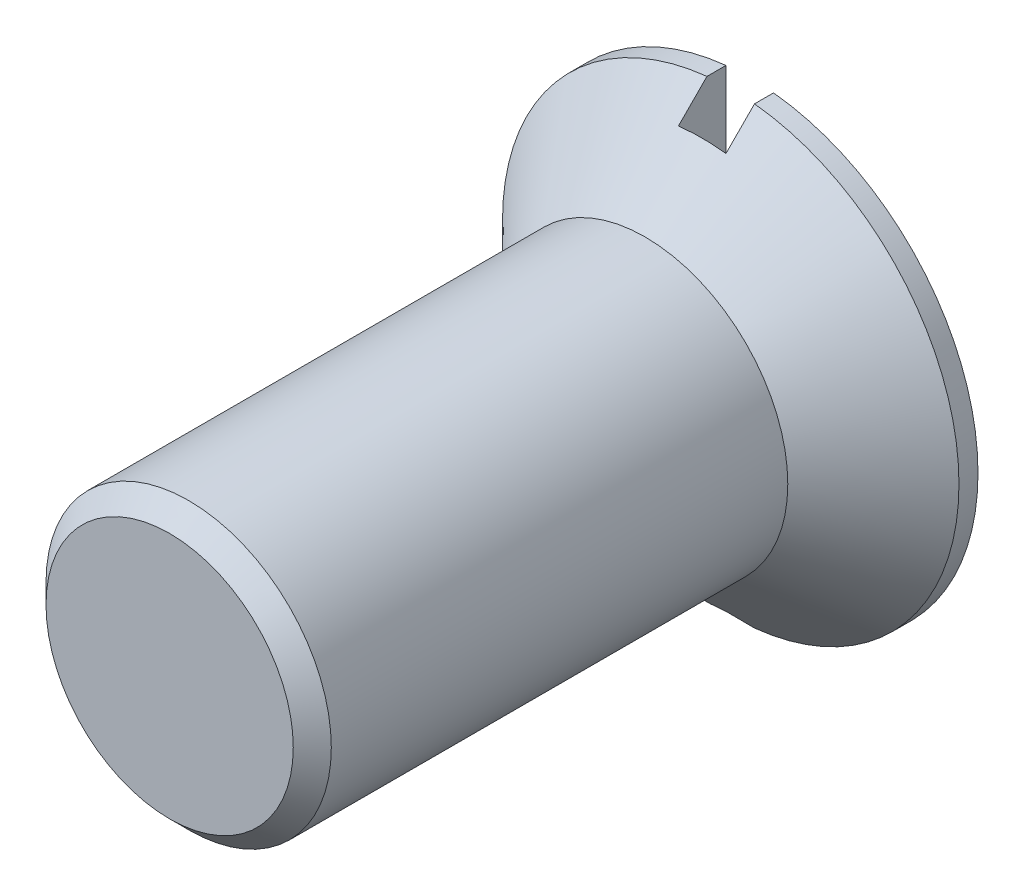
ISO-10303-21;
HEADER;
FILE_DESCRIPTION(('STEP AP214'),'2;1');
FILE_NAME('part.step','',(''),(''),'','','');
FILE_SCHEMA(('AUTOMOTIVE_DESIGN { 1 0 10303 214 1 1 1 1 }'));
ENDSEC;
DATA;
#1=APPLICATION_CONTEXT('core data for automotive mechanical design processes');
#2=APPLICATION_PROTOCOL_DEFINITION('international standard','automotive_design',2000,#1);
#3=PRODUCT_CONTEXT('',#1,'mechanical');
#4=PRODUCT('Part','Part','',(#3));
#5=PRODUCT_RELATED_PRODUCT_CATEGORY('part','',(#4));
#6=PRODUCT_DEFINITION_FORMATION('','',#4);
#7=PRODUCT_DEFINITION_CONTEXT('part definition',#1,'design');
#8=PRODUCT_DEFINITION('design','',#6,#7);
#9=PRODUCT_DEFINITION_SHAPE('','',#8);
#10=(LENGTH_UNIT() NAMED_UNIT(*) SI_UNIT(.MILLI.,.METRE.));
#11=(NAMED_UNIT(*) PLANE_ANGLE_UNIT() SI_UNIT($,.RADIAN.));
#12=(NAMED_UNIT(*) SI_UNIT($,.STERADIAN.) SOLID_ANGLE_UNIT());
#13=UNCERTAINTY_MEASURE_WITH_UNIT(LENGTH_MEASURE(1.E-05),#10,'distance_accuracy_value','');
#14=(GEOMETRIC_REPRESENTATION_CONTEXT(3) GLOBAL_UNCERTAINTY_ASSIGNED_CONTEXT((#13)) GLOBAL_UNIT_ASSIGNED_CONTEXT((#10,
#11,#12)) REPRESENTATION_CONTEXT('',''));
#15=CARTESIAN_POINT('',(0.,0.,0.));
#16=DIRECTION('',(0.,0.,1.));
#17=DIRECTION('',(1.,0.,0.));
#18=AXIS2_PLACEMENT_3D('',#15,#16,#17);
#19=CARTESIAN_POINT('',(0.,0.,0.));
#20=DIRECTION('',(0.,0.,1.));
#21=DIRECTION('',(1.,0.,0.));
#22=AXIS2_PLACEMENT_3D('',#19,#20,#21);
#23=CYLINDRICAL_SURFACE('',#22,2.4);
#24=CARTESIAN_POINT('',(0.,0.,-1.1));
#25=DIRECTION('',(0.,0.,1.));
#26=DIRECTION('',(1.,0.,0.));
#27=AXIS2_PLACEMENT_3D('',#24,#25,#26);
#28=CIRCLE('',#27,2.4);
#29=CARTESIAN_POINT('',(-0.25,2.386943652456,-1.1));
#30=VERTEX_POINT('',#29);
#31=CARTESIAN_POINT('',(-0.25,-2.386943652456,-1.1));
#32=VERTEX_POINT('',#31);
#33=EDGE_CURVE('E117',#30,#32,#28,.T.);
#34=ORIENTED_EDGE('',*,*,#33,.T.);
#35=DIRECTION('',(0.,0.,1.));
#36=VECTOR('',#35,1.);
#37=CARTESIAN_POINT('',(-0.25,-2.386943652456,0.));
#38=LINE('',#37,#36);
#39=CARTESIAN_POINT('',(-0.25,-2.386943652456,-0.899999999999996));
#40=VERTEX_POINT('',#39);
#41=EDGE_CURVE('E120',#32,#40,#38,.T.);
#42=ORIENTED_EDGE('',*,*,#41,.T.);
#43=CARTESIAN_POINT('',(0.,0.,-0.899999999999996));
#44=DIRECTION('',(0.,0.,1.));
#45=DIRECTION('',(1.,0.,0.));
#46=AXIS2_PLACEMENT_3D('',#43,#44,#45);
#47=CIRCLE('',#46,2.4);
#48=CARTESIAN_POINT('',(-0.25,2.386943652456,-0.899999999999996));
#49=VERTEX_POINT('',#48);
#50=EDGE_CURVE('E126',#49,#40,#47,.T.);
#51=ORIENTED_EDGE('',*,*,#50,.F.);
#52=DIRECTION('',(0.,0.,1.));
#53=VECTOR('',#52,1.);
#54=CARTESIAN_POINT('',(-0.25,2.386943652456,0.));
#55=LINE('',#54,#53);
#56=EDGE_CURVE('E155',#49,#30,#55,.F.);
#57=ORIENTED_EDGE('',*,*,#56,.T.);
#58=EDGE_LOOP('',(#34,#42,#51,#57));
#59=FACE_BOUND('',#58,.T.);
#60=ADVANCED_FACE('F46',(#59),#23,.T.);
#61=CARTESIAN_POINT('',(-2.4,0.,-1.1));
#62=DIRECTION('',(0.,0.,1.));
#63=DIRECTION('',(1.,0.,0.));
#64=AXIS2_PLACEMENT_3D('',#61,#62,#63);
#65=PLANE('',#64);
#66=ORIENTED_EDGE('',*,*,#33,.F.);
#67=DIRECTION('',(0.,-1.,0.));
#68=VECTOR('',#67,1.);
#69=CARTESIAN_POINT('',(-0.25,0.,-1.1));
#70=LINE('',#69,#68);
#71=EDGE_CURVE('E104',#30,#32,#70,.T.);
#72=ORIENTED_EDGE('',*,*,#71,.T.);
#73=EDGE_LOOP('',(#66,#72));
#74=FACE_BOUND('',#73,.T.);
#75=ADVANCED_FACE('F174',(#74),#65,.F.);
#76=CARTESIAN_POINT('',(0.,0.,5.));
#77=DIRECTION('',(0.,0.,-1.));
#78=DIRECTION('',(-1.,0.,0.));
#79=AXIS2_PLACEMENT_3D('',#76,#77,#78);
#80=CYLINDRICAL_SURFACE('',#79,1.5);
#81=CARTESIAN_POINT('',(0.,0.,4.8));
#82=DIRECTION('',(0.,0.,1.));
#83=DIRECTION('',(1.,0.,0.));
#84=AXIS2_PLACEMENT_3D('',#81,#82,#83);
#85=CIRCLE('',#84,1.5);
#86=CARTESIAN_POINT('',(-1.5,0.,4.8));
#87=VERTEX_POINT('',#86);
#88=EDGE_CURVE('E105',#87,#87,#85,.F.);
#89=ORIENTED_EDGE('',*,*,#88,.T.);
#90=EDGE_LOOP('',(#89));
#91=FACE_BOUND('',#90,.T.);
#92=CARTESIAN_POINT('',(0.,0.,0.));
#93=DIRECTION('',(0.,0.,1.));
#94=DIRECTION('',(1.,0.,0.));
#95=AXIS2_PLACEMENT_3D('',#92,#93,#94);
#96=CIRCLE('',#95,1.5);
#97=CARTESIAN_POINT('',(1.5,0.,0.));
#98=VERTEX_POINT('',#97);
#99=EDGE_CURVE('E127',#98,#98,#96,.T.);
#100=ORIENTED_EDGE('',*,*,#99,.T.);
#101=EDGE_LOOP('',(#100));
#102=FACE_BOUND('',#101,.T.);
#103=ADVANCED_FACE('F183',(#91,#102),#80,.T.);
#104=CARTESIAN_POINT('',(0.,0.,5.));
#105=DIRECTION('',(0.,0.,1.));
#106=DIRECTION('',(1.,0.,0.));
#107=AXIS2_PLACEMENT_3D('',#104,#105,#106);
#108=PLANE('',#107);
#109=CARTESIAN_POINT('',(0.,0.,5.));
#110=DIRECTION('',(0.,0.,1.));
#111=DIRECTION('',(1.,0.,0.));
#112=AXIS2_PLACEMENT_3D('',#109,#110,#111);
#113=CIRCLE('',#112,1.3);
#114=CARTESIAN_POINT('',(-1.3,0.,5.));
#115=VERTEX_POINT('',#114);
#116=EDGE_CURVE('E130',#115,#115,#113,.T.);
#117=ORIENTED_EDGE('',*,*,#116,.T.);
#118=EDGE_LOOP('',(#117));
#119=FACE_BOUND('',#118,.T.);
#120=ADVANCED_FACE('F187',(#119),#108,.T.);
#121=CARTESIAN_POINT('',(0.,0.,5.));
#122=DIRECTION('',(0.,0.,-1.));
#123=DIRECTION('',(-1.,0.,0.));
#124=AXIS2_PLACEMENT_3D('',#121,#122,#123);
#125=CONICAL_SURFACE('',#124,1.3,0.785398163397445);
#126=CARTESIAN_POINT('',(-1.5,0.,4.8));
#127=CARTESIAN_POINT('',(-1.49791666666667,0.,4.80208333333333));
#128=CARTESIAN_POINT('',(-1.49583333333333,0.,4.80416666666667));
#129=CARTESIAN_POINT('',(-1.49166666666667,0.,4.80833333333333));
#130=CARTESIAN_POINT('',(-1.48958333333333,0.,4.81041666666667));
#131=CARTESIAN_POINT('',(-1.48541666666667,0.,4.81458333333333));
#132=CARTESIAN_POINT('',(-1.48333333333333,0.,4.81666666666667));
#133=CARTESIAN_POINT('',(-1.47916666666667,0.,4.82083333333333));
#134=CARTESIAN_POINT('',(-1.47708333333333,0.,4.82291666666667));
#135=CARTESIAN_POINT('',(-1.47291666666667,0.,4.82708333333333));
#136=CARTESIAN_POINT('',(-1.47083333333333,0.,4.82916666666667));
#137=CARTESIAN_POINT('',(-1.46666666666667,0.,4.83333333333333));
#138=CARTESIAN_POINT('',(-1.46458333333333,0.,4.83541666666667));
#139=CARTESIAN_POINT('',(-1.46041666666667,0.,4.83958333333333));
#140=CARTESIAN_POINT('',(-1.45833333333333,0.,4.84166666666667));
#141=CARTESIAN_POINT('',(-1.45416666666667,0.,4.84583333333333));
#142=CARTESIAN_POINT('',(-1.45208333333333,0.,4.84791666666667));
#143=CARTESIAN_POINT('',(-1.44791666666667,0.,4.85208333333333));
#144=CARTESIAN_POINT('',(-1.44583333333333,0.,4.85416666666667));
#145=CARTESIAN_POINT('',(-1.44166666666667,0.,4.85833333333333));
#146=CARTESIAN_POINT('',(-1.43958333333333,0.,4.86041666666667));
#147=CARTESIAN_POINT('',(-1.43541666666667,0.,4.86458333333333));
#148=CARTESIAN_POINT('',(-1.43333333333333,0.,4.86666666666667));
#149=CARTESIAN_POINT('',(-1.42916666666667,0.,4.87083333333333));
#150=CARTESIAN_POINT('',(-1.42708333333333,0.,4.87291666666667));
#151=CARTESIAN_POINT('',(-1.42291666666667,0.,4.87708333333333));
#152=CARTESIAN_POINT('',(-1.42083333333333,0.,4.87916666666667));
#153=CARTESIAN_POINT('',(-1.41666666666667,0.,4.88333333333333));
#154=CARTESIAN_POINT('',(-1.41458333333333,0.,4.88541666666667));
#155=CARTESIAN_POINT('',(-1.41041666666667,0.,4.88958333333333));
#156=CARTESIAN_POINT('',(-1.40833333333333,0.,4.89166666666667));
#157=CARTESIAN_POINT('',(-1.40416666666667,0.,4.89583333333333));
#158=CARTESIAN_POINT('',(-1.40208333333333,0.,4.89791666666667));
#159=CARTESIAN_POINT('',(-1.39791666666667,0.,4.90208333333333));
#160=CARTESIAN_POINT('',(-1.39583333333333,0.,4.90416666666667));
#161=CARTESIAN_POINT('',(-1.39166666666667,0.,4.90833333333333));
#162=CARTESIAN_POINT('',(-1.38958333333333,0.,4.91041666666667));
#163=CARTESIAN_POINT('',(-1.38541666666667,0.,4.91458333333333));
#164=CARTESIAN_POINT('',(-1.38333333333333,0.,4.91666666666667));
#165=CARTESIAN_POINT('',(-1.37916666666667,0.,4.92083333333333));
#166=CARTESIAN_POINT('',(-1.37708333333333,0.,4.92291666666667));
#167=CARTESIAN_POINT('',(-1.37291666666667,0.,4.92708333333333));
#168=CARTESIAN_POINT('',(-1.37083333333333,0.,4.92916666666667));
#169=CARTESIAN_POINT('',(-1.36666666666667,0.,4.93333333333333));
#170=CARTESIAN_POINT('',(-1.36458333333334,0.,4.93541666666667));
#171=CARTESIAN_POINT('',(-1.36041666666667,0.,4.93958333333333));
#172=CARTESIAN_POINT('',(-1.35833333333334,0.,4.94166666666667));
#173=CARTESIAN_POINT('',(-1.35416666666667,0.,4.94583333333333));
#174=CARTESIAN_POINT('',(-1.35208333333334,0.,4.94791666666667));
#175=CARTESIAN_POINT('',(-1.34791666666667,0.,4.95208333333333));
#176=CARTESIAN_POINT('',(-1.34583333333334,0.,4.95416666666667));
#177=CARTESIAN_POINT('',(-1.34166666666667,0.,4.95833333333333));
#178=CARTESIAN_POINT('',(-1.33958333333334,0.,4.96041666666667));
#179=CARTESIAN_POINT('',(-1.33541666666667,0.,4.96458333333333));
#180=CARTESIAN_POINT('',(-1.33333333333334,0.,4.96666666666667));
#181=CARTESIAN_POINT('',(-1.32916666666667,0.,4.97083333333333));
#182=CARTESIAN_POINT('',(-1.32708333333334,0.,4.97291666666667));
#183=CARTESIAN_POINT('',(-1.32291666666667,0.,4.97708333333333));
#184=CARTESIAN_POINT('',(-1.32083333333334,0.,4.97916666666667));
#185=CARTESIAN_POINT('',(-1.31666666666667,0.,4.98333333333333));
#186=CARTESIAN_POINT('',(-1.31458333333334,0.,4.98541666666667));
#187=CARTESIAN_POINT('',(-1.31041666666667,0.,4.98958333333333));
#188=CARTESIAN_POINT('',(-1.30833333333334,0.,4.99166666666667));
#189=CARTESIAN_POINT('',(-1.30416666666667,0.,4.99583333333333));
#190=CARTESIAN_POINT('',(-1.30208333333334,0.,4.99791666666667));
#191=CARTESIAN_POINT('',(-1.3,0.,5.));
#192=B_SPLINE_CURVE_WITH_KNOTS('',3,(#126,#127,#128,#129,#130,#131,#132,#133,#134,#135,#136,
#137,#138,#139,#140,#141,#142,#143,#144,#145,#146,#147,#148,#149,#150,#151,#152,#153,#154,#155,
#156,#157,#158,#159,#160,#161,#162,#163,#164,#165,#166,#167,#168,#169,#170,#171,#172,#173,#174,
#175,#176,#177,#178,#179,#180,#181,#182,#183,#184,#185,#186,#187,#188,#189,#190,#191),
.UNSPECIFIED.,.F.,.F.,(4,2,2,2,2,2,2,2,2,2,2,2,2,2,2,2,2,2,2,2,2,2,2,2,2,2,2,2,2,2,2,2,4),(0.,
0.00883883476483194,0.0176776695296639,0.0265165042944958,0.0353553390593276,0.044194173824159,
0.0530330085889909,0.0618718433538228,0.0707106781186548,0.0795495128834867,0.0883883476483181,
0.09722718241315,0.106066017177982,0.114904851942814,0.123743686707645,0.132582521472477,
0.141421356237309,0.150260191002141,0.159099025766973,0.167937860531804,0.176776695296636,
0.185615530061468,0.1944543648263,0.203293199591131,0.212132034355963,0.220970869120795,
0.229809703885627,0.238648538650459,0.24748737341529,0.256326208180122,0.265165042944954,
0.274003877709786,0.282842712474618),.UNSPECIFIED.);
#193=EDGE_CURVE('BSEAM48',#87,#115,#192,.T.);
#194=ORIENTED_EDGE('',*,*,#88,.F.);
#195=ORIENTED_EDGE('',*,*,#116,.F.);
#196=ORIENTED_EDGE('',*,*,#193,.T.);
#197=ORIENTED_EDGE('',*,*,#193,.F.);
#198=EDGE_LOOP('',(#194,#196,#195,#197));
#199=FACE_BOUND('',#198,.T.);
#200=ADVANCED_FACE('F48',(#199),#125,.T.);
#201=CARTESIAN_POINT('',(0.,0.,-0.899999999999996));
#202=DIRECTION('',(0.,0.,-1.));
#203=DIRECTION('',(-1.,0.,0.));
#204=AXIS2_PLACEMENT_3D('',#201,#202,#203);
#205=CONICAL_SURFACE('',#204,2.4,0.78539816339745);
#206=CARTESIAN_POINT('',(0.,0.,-0.599999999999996));
#207=DIRECTION('',(0.,0.,-1.));
#208=DIRECTION('',(-1.,0.,0.));
#209=AXIS2_PLACEMENT_3D('',#206,#207,#208);
#210=CIRCLE('',#209,2.1);
#211=CARTESIAN_POINT('',(-0.25,2.0850659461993,-0.599999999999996));
#212=VERTEX_POINT('',#211);
#213=CARTESIAN_POINT('',(0.25,2.0850659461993,-0.599999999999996));
#214=VERTEX_POINT('',#213);
#215=EDGE_CURVE('E13',#212,#214,#210,.T.);
#216=ORIENTED_EDGE('',*,*,#215,.F.);
#217=CARTESIAN_POINT('',(-0.250000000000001,-5.27990416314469,-3.78581951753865));
#218=CARTESIAN_POINT('',(-0.250000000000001,-5.09809030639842,-3.604210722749));
#219=CARTESIAN_POINT('',(-0.250000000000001,-4.91626746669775,-3.42261091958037));
#220=CARTESIAN_POINT('',(-0.25,-4.55259133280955,-3.0594398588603));
#221=CARTESIAN_POINT('',(-0.25,-4.37073803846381,-2.87786860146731));
#222=CARTESIAN_POINT('',(-0.25,-4.00696803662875,-2.51474476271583));
#223=CARTESIAN_POINT('',(-0.25,-3.82505132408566,-2.33319218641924));
#224=CARTESIAN_POINT('',(-0.25,-3.4611561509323,-1.97015084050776));
#225=CARTESIAN_POINT('',(-0.25,-3.27917769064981,-1.78866207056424));
#226=CARTESIAN_POINT('',(-0.25,-2.91365611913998,-1.4243235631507));
#227=CARTESIAN_POINT('',(-0.25,-2.7301122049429,-1.24147463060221));
#228=CARTESIAN_POINT('',(-0.25,-2.36283705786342,-0.875959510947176));
#229=CARTESIAN_POINT('',(-0.25,-2.17910582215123,-0.693293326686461));
#230=CARTESIAN_POINT('',(-0.25,-1.81130890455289,-0.328324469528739));
#231=CARTESIAN_POINT('',(-0.25,-1.62724324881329,-0.146021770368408));
#232=CARTESIAN_POINT('',(-0.25,-1.35043306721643,0.126705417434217));
#233=CARTESIAN_POINT('',(-0.25,-1.25804554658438,0.217492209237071));
#234=CARTESIAN_POINT('',(-0.25,-1.07282622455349,0.398611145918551));
#235=CARTESIAN_POINT('',(-0.25,-0.979994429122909,0.488943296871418));
#236=CARTESIAN_POINT('',(-0.25,-0.861245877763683,0.603228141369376));
#237=CARTESIAN_POINT('',(-0.25,-0.835787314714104,0.627656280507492));
#238=CARTESIAN_POINT('',(-0.25,-0.784768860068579,0.676406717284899));
#239=CARTESIAN_POINT('',(-0.25,-0.759208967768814,0.700729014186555));
#240=CARTESIAN_POINT('',(-0.25,-0.682373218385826,0.773465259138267));
#241=CARTESIAN_POINT('',(-0.25,-0.630908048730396,0.821680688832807));
#242=CARTESIAN_POINT('',(-0.25,-0.544175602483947,0.901302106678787));
#243=CARTESIAN_POINT('',(-0.25,-0.509175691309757,0.932997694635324));
#244=CARTESIAN_POINT('',(-0.25,-0.438403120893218,0.995598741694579));
#245=CARTESIAN_POINT('',(-0.25,-0.402629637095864,1.02650327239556));
#246=CARTESIAN_POINT('',(-0.25,-0.33488403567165,1.08247435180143));
#247=CARTESIAN_POINT('',(-0.25,-0.303088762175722,1.1077488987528));
#248=CARTESIAN_POINT('',(-0.25,-0.254007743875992,1.14376921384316));
#249=CARTESIAN_POINT('',(-0.25,-0.237420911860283,1.15545771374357));
#250=CARTESIAN_POINT('',(-0.25,-0.203594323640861,1.17783812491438));
#251=CARTESIAN_POINT('',(-0.25,-0.186355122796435,1.18853085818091));
#252=CARTESIAN_POINT('',(-0.25,-0.152733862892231,1.2073340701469));
#253=CARTESIAN_POINT('',(-0.25,-0.136438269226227,1.21559581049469));
#254=CARTESIAN_POINT('',(-0.25,-0.102951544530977,1.23005098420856));
#255=CARTESIAN_POINT('',(-0.25,-0.0857625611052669,1.23624913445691));
#256=CARTESIAN_POINT('',(-0.25,-0.0537894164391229,1.24465145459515));
#257=CARTESIAN_POINT('',(-0.25,-0.0391501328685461,1.24738301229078));
#258=CARTESIAN_POINT('',(-0.25,-0.00963017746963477,1.25024310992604));
#259=CARTESIAN_POINT('',(-0.25,0.00524999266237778,1.25037650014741));
#260=CARTESIAN_POINT('',(-0.25,0.0347559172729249,1.24802557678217));
#261=CARTESIAN_POINT('',(-0.25,0.0493821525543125,1.24554692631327));
#262=CARTESIAN_POINT('',(-0.25,0.0781155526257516,1.23845340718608));
#263=CARTESIAN_POINT('',(-0.25,0.0922213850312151,1.23383341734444));
#264=CARTESIAN_POINT('',(-0.25,0.124878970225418,1.22108867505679));
#265=CARTESIAN_POINT('',(-0.25,0.143163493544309,1.21229995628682));
#266=CARTESIAN_POINT('',(-0.25,0.17881464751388,1.1929985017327));
#267=CARTESIAN_POINT('',(-0.25,0.196178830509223,1.18248144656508));
#268=CARTESIAN_POINT('',(-0.25,0.230363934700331,1.16029809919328));
#269=CARTESIAN_POINT('',(-0.25,0.247178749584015,1.1486225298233));
#270=CARTESIAN_POINT('',(-0.25,0.280279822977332,1.12459515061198));
#271=CARTESIAN_POINT('',(-0.25,0.296566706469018,1.11224419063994));
#272=CARTESIAN_POINT('',(-0.25,0.349163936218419,1.07118029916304));
#273=CARTESIAN_POINT('',(-0.25,0.384740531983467,1.04153431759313));
#274=CARTESIAN_POINT('',(-0.25,0.4549719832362,0.981164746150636));
#275=CARTESIAN_POINT('',(-0.25,0.48962639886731,0.950440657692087));
#276=CARTESIAN_POINT('',(-0.25,0.558436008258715,0.888338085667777));
#277=CARTESIAN_POINT('',(-0.25,0.592590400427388,0.856958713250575));
#278=CARTESIAN_POINT('',(-0.25,0.660546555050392,0.793836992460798));
#279=CARTESIAN_POINT('',(-0.25,0.694348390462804,0.762094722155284));
#280=CARTESIAN_POINT('',(-0.25,0.795064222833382,0.666847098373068));
#281=CARTESIAN_POINT('',(-0.25,0.861646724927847,0.602991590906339));
#282=CARTESIAN_POINT('',(-0.25,0.994316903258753,0.474873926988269));
#283=CARTESIAN_POINT('',(-0.25,1.06040492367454,0.410612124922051));
#284=CARTESIAN_POINT('',(-0.25,1.25805740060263,0.217671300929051));
#285=CARTESIAN_POINT('',(-0.25,1.38924745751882,0.0886089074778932));
#286=CARTESIAN_POINT('',(-0.25,1.65122819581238,-0.169922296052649));
#287=CARTESIAN_POINT('',(-0.25,1.78201887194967,-0.29939111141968));
#288=CARTESIAN_POINT('',(-0.25,2.0434227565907,-0.558588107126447));
#289=CARTESIAN_POINT('',(-0.25,2.17403589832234,-0.688316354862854));
#290=CARTESIAN_POINT('',(-0.25,2.4351371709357,-0.947897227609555));
#291=CARTESIAN_POINT('',(-0.25,2.56562530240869,-1.07774985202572));
#292=CARTESIAN_POINT('',(-0.25,2.95728977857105,-1.4677376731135));
#293=CARTESIAN_POINT('',(-0.25,3.21835039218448,-1.7279891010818));
#294=CARTESIAN_POINT('',(-0.249999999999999,3.74031109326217,-2.24861248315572));
#295=CARTESIAN_POINT('',(-0.249999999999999,4.00121119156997,-2.50898442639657));
#296=CARTESIAN_POINT('',(-0.249999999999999,4.3469294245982,-2.85410969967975));
#297=CARTESIAN_POINT('',(-0.249999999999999,4.43178362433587,-2.93882689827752));
#298=CARTESIAN_POINT('',(-0.249999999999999,4.60148601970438,-3.10826989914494));
#299=CARTESIAN_POINT('',(-0.249999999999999,4.68633421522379,-3.19299570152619));
#300=CARTESIAN_POINT('',(-0.249999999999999,4.85597303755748,-3.36240212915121));
#301=CARTESIAN_POINT('',(-0.249999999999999,4.9407636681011,-3.44708275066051));
#302=CARTESIAN_POINT('',(-0.249999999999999,5.11033832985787,-3.61644801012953));
#303=CARTESIAN_POINT('',(-0.249999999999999,5.19512236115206,-3.7011326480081));
#304=CARTESIAN_POINT('',(-0.249999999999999,5.27990416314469,-3.78581951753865));
#305=B_SPLINE_CURVE_WITH_KNOTS('',3,(#217,#218,#219,#220,#221,#222,#223,#224,#225,#226,#227,
#228,#229,#230,#231,#232,#233,#234,#235,#236,#237,#238,#239,#240,#241,#242,#243,#244,#245,#246,
#247,#248,#249,#250,#251,#252,#253,#254,#255,#256,#257,#258,#259,#260,#261,#262,#263,#264,#265,
#266,#267,#268,#269,#270,#271,#272,#273,#274,#275,#276,#277,#278,#279,#280,#281,#282,#283,#284,
#285,#286,#287,#288,#289,#290,#291,#292,#293,#294,#295,#296,#297,#298,#299,#300,#301,#302,#303,
#304),.UNSPECIFIED.,.F.,.F.,(4,2,2,2,2,2,2,2,2,2,2,2,2,2,2,2,2,2,2,2,2,2,2,2,2,2,2,2,2,2,2,2,2,
2,2,2,2,2,2,2,2,2,2,4),(0.,0.77093598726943,1.541876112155,2.31291127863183,3.08394241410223,
3.86118024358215,4.63842999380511,5.41562138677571,5.80420739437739,6.19278819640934,
6.29863612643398,6.4044847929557,6.61604344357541,6.75769127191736,6.89949835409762,
7.02127405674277,7.08212769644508,7.14293064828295,7.19765829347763,7.25225997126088,
7.29673998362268,7.34113695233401,7.38543786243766,7.42984527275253,7.49054254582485,
7.55139388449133,7.61277934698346,7.67408926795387,7.81295841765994,7.95189265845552,
8.09102947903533,8.23013691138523,8.50689219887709,8.78343252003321,9.33552629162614,
9.88762727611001,10.4398976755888,10.992165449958,12.0980364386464,13.2038219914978,
13.5635373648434,13.9232582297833,14.2827611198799,14.6422585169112),.UNSPECIFIED.);
#306=EDGE_CURVE('E122',#212,#49,#305,.T.);
#307=ORIENTED_EDGE('',*,*,#306,.T.);
#308=ORIENTED_EDGE('',*,*,#50,.T.);
#309=CARTESIAN_POINT('',(-0.25,-2.0850659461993,-0.599999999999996));
#310=VERTEX_POINT('',#309);
#311=EDGE_CURVE('E69',#40,#310,#305,.T.);
#312=ORIENTED_EDGE('',*,*,#311,.T.);
#313=CARTESIAN_POINT('',(0.25,-2.0850659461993,-0.599999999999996));
#314=VERTEX_POINT('',#313);
#315=EDGE_CURVE('E50',#314,#310,#210,.T.);
#316=ORIENTED_EDGE('',*,*,#315,.F.);
#317=CARTESIAN_POINT('',(0.250000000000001,5.27990416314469,-3.78581951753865));
#318=CARTESIAN_POINT('',(0.250000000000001,5.09809030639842,-3.604210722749));
#319=CARTESIAN_POINT('',(0.250000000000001,4.91626746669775,-3.42261091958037));
#320=CARTESIAN_POINT('',(0.250000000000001,4.55259133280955,-3.0594398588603));
#321=CARTESIAN_POINT('',(0.250000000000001,4.3707380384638,-2.87786860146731));
#322=CARTESIAN_POINT('',(0.250000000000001,4.00696803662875,-2.51474476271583));
#323=CARTESIAN_POINT('',(0.250000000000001,3.82505132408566,-2.33319218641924));
#324=CARTESIAN_POINT('',(0.25,3.46115615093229,-1.97015084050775));
#325=CARTESIAN_POINT('',(0.25,3.27917769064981,-1.78866207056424));
#326=CARTESIAN_POINT('',(0.25,2.91365611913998,-1.4243235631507));
#327=CARTESIAN_POINT('',(0.25,2.7301122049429,-1.24147463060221));
#328=CARTESIAN_POINT('',(0.25,2.36283705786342,-0.875959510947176));
#329=CARTESIAN_POINT('',(0.25,2.17910582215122,-0.693293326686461));
#330=CARTESIAN_POINT('',(0.25,1.81130890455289,-0.328324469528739));
#331=CARTESIAN_POINT('',(0.25,1.62724324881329,-0.146021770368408));
#332=CARTESIAN_POINT('',(0.25,1.35043306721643,0.126705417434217));
#333=CARTESIAN_POINT('',(0.25,1.25804554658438,0.217492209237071));
#334=CARTESIAN_POINT('',(0.25,1.07282622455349,0.398611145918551));
#335=CARTESIAN_POINT('',(0.25,0.979994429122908,0.488943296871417));
#336=CARTESIAN_POINT('',(0.25,0.861245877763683,0.603228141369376));
#337=CARTESIAN_POINT('',(0.25,0.835787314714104,0.627656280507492));
#338=CARTESIAN_POINT('',(0.25,0.784768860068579,0.676406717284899));
#339=CARTESIAN_POINT('',(0.25,0.759208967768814,0.700729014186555));
#340=CARTESIAN_POINT('',(0.25,0.682373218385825,0.773465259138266));
#341=CARTESIAN_POINT('',(0.25,0.630908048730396,0.821680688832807));
#342=CARTESIAN_POINT('',(0.25,0.544175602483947,0.901302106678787));
#343=CARTESIAN_POINT('',(0.25,0.509175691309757,0.932997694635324));
#344=CARTESIAN_POINT('',(0.25,0.438403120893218,0.995598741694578));
#345=CARTESIAN_POINT('',(0.25,0.402629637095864,1.02650327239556));
#346=CARTESIAN_POINT('',(0.25,0.334884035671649,1.08247435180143));
#347=CARTESIAN_POINT('',(0.25,0.303088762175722,1.1077488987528));
#348=CARTESIAN_POINT('',(0.25,0.254007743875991,1.14376921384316));
#349=CARTESIAN_POINT('',(0.25,0.237420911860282,1.15545771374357));
#350=CARTESIAN_POINT('',(0.25,0.20359432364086,1.17783812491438));
#351=CARTESIAN_POINT('',(0.25,0.186355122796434,1.18853085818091));
#352=CARTESIAN_POINT('',(0.25,0.15273386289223,1.2073340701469));
#353=CARTESIAN_POINT('',(0.25,0.136438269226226,1.21559581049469));
#354=CARTESIAN_POINT('',(0.25,0.102951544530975,1.23005098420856));
#355=CARTESIAN_POINT('',(0.25,0.0857625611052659,1.23624913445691));
#356=CARTESIAN_POINT('',(0.25,0.0537894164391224,1.24465145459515));
#357=CARTESIAN_POINT('',(0.25,0.0391501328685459,1.24738301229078));
#358=CARTESIAN_POINT('',(0.25,0.00963017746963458,1.25024310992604));
#359=CARTESIAN_POINT('',(0.25,-0.00524999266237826,1.25037650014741));
#360=CARTESIAN_POINT('',(0.25,-0.0347559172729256,1.24802557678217));
#361=CARTESIAN_POINT('',(0.25,-0.0493821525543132,1.24554692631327));
#362=CARTESIAN_POINT('',(0.25,-0.0781155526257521,1.23845340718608));
#363=CARTESIAN_POINT('',(0.25,-0.0922213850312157,1.23383341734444));
#364=CARTESIAN_POINT('',(0.25,-0.124878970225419,1.22108867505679));
#365=CARTESIAN_POINT('',(0.25,-0.14316349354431,1.21229995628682));
#366=CARTESIAN_POINT('',(0.25,-0.178814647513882,1.1929985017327));
#367=CARTESIAN_POINT('',(0.25,-0.196178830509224,1.18248144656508));
#368=CARTESIAN_POINT('',(0.25,-0.230363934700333,1.16029809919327));
#369=CARTESIAN_POINT('',(0.25,-0.247178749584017,1.1486225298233));
#370=CARTESIAN_POINT('',(0.25,-0.280279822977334,1.12459515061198));
#371=CARTESIAN_POINT('',(0.25,-0.29656670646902,1.11224419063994));
#372=CARTESIAN_POINT('',(0.25,-0.349163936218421,1.07118029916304));
#373=CARTESIAN_POINT('',(0.25,-0.384740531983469,1.04153431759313));
#374=CARTESIAN_POINT('',(0.25,-0.454971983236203,0.981164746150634));
#375=CARTESIAN_POINT('',(0.25,-0.489626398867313,0.950440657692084));
#376=CARTESIAN_POINT('',(0.25,-0.558436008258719,0.888338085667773));
#377=CARTESIAN_POINT('',(0.25,-0.592590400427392,0.856958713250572));
#378=CARTESIAN_POINT('',(0.25,-0.660546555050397,0.793836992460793));
#379=CARTESIAN_POINT('',(0.25,-0.694348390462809,0.762094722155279));
#380=CARTESIAN_POINT('',(0.25,-0.795064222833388,0.666847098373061));
#381=CARTESIAN_POINT('',(0.25,-0.861646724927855,0.602991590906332));
#382=CARTESIAN_POINT('',(0.25,-0.994316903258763,0.47487392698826));
#383=CARTESIAN_POINT('',(0.25,-1.06040492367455,0.410612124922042));
#384=CARTESIAN_POINT('',(0.25,-1.25805740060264,0.217671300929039));
#385=CARTESIAN_POINT('',(0.25,-1.38924745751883,0.0886089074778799));
#386=CARTESIAN_POINT('',(0.25,-1.6512281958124,-0.169922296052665));
#387=CARTESIAN_POINT('',(0.25,-1.78201887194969,-0.299391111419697));
#388=CARTESIAN_POINT('',(0.25,-2.04342275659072,-0.558588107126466));
#389=CARTESIAN_POINT('',(0.25,-2.17403589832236,-0.688316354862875));
#390=CARTESIAN_POINT('',(0.25,-2.43513717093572,-0.947897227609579));
#391=CARTESIAN_POINT('',(0.25,-2.56562530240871,-1.07774985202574));
#392=CARTESIAN_POINT('',(0.25,-2.95728977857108,-1.46773767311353));
#393=CARTESIAN_POINT('',(0.25,-3.21835039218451,-1.72798910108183));
#394=CARTESIAN_POINT('',(0.25,-3.74031109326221,-2.24861248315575));
#395=CARTESIAN_POINT('',(0.25,-4.00121119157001,-2.5089844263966));
#396=CARTESIAN_POINT('',(0.249999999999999,-4.34692942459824,-2.85410969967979));
#397=CARTESIAN_POINT('',(0.249999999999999,-4.43178362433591,-2.93882689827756));
#398=CARTESIAN_POINT('',(0.249999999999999,-4.60148601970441,-3.10826989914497));
#399=CARTESIAN_POINT('',(0.249999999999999,-4.68633421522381,-3.19299570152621));
#400=CARTESIAN_POINT('',(0.249999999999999,-4.85597303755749,-3.36240212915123));
#401=CARTESIAN_POINT('',(0.249999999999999,-4.94076366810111,-3.44708275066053));
#402=CARTESIAN_POINT('',(0.249999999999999,-5.11033832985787,-3.61644801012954));
#403=CARTESIAN_POINT('',(0.249999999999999,-5.19512236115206,-3.70113264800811));
#404=CARTESIAN_POINT('',(0.249999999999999,-5.27990416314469,-3.78581951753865));
#405=B_SPLINE_CURVE_WITH_KNOTS('',3,(#317,#318,#319,#320,#321,#322,#323,#324,#325,#326,#327,
#328,#329,#330,#331,#332,#333,#334,#335,#336,#337,#338,#339,#340,#341,#342,#343,#344,#345,#346,
#347,#348,#349,#350,#351,#352,#353,#354,#355,#356,#357,#358,#359,#360,#361,#362,#363,#364,#365,
#366,#367,#368,#369,#370,#371,#372,#373,#374,#375,#376,#377,#378,#379,#380,#381,#382,#383,#384,
#385,#386,#387,#388,#389,#390,#391,#392,#393,#394,#395,#396,#397,#398,#399,#400,#401,#402,#403,
#404),.UNSPECIFIED.,.F.,.F.,(4,2,2,2,2,2,2,2,2,2,2,2,2,2,2,2,2,2,2,2,2,2,2,2,2,2,2,2,2,2,2,2,2,
2,2,2,2,2,2,2,2,2,2,4),(0.,0.77093598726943,1.541876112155,2.31291127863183,3.08394241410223,
3.86118024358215,4.63842999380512,5.41562138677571,5.80420739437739,6.19278819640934,
6.29863612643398,6.4044847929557,6.61604344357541,6.75769127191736,6.89949835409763,
7.02127405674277,7.08212769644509,7.14293064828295,7.19765829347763,7.25225997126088,
7.29673998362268,7.34113695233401,7.38543786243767,7.42984527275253,7.49054254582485,
7.55139388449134,7.61277934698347,7.67408926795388,7.81295841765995,7.95189265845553,
8.09102947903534,8.23013691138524,8.50689219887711,8.78343252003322,9.33552629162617,
9.88762727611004,10.4398976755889,10.992165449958,12.0980364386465,13.2038219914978,
13.5635373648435,13.9232582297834,14.2827611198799,14.6422585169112),.UNSPECIFIED.);
#406=CARTESIAN_POINT('',(0.25,-2.386943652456,-0.899999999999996));
#407=VERTEX_POINT('',#406);
#408=EDGE_CURVE('E113',#314,#407,#405,.T.);
#409=ORIENTED_EDGE('',*,*,#408,.T.);
#410=CARTESIAN_POINT('',(0.25,2.386943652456,-0.899999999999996));
#411=VERTEX_POINT('',#410);
#412=EDGE_CURVE('E112',#407,#411,#47,.T.);
#413=ORIENTED_EDGE('',*,*,#412,.T.);
#414=EDGE_CURVE('E156',#411,#214,#405,.T.);
#415=ORIENTED_EDGE('',*,*,#414,.T.);
#416=EDGE_LOOP('',(#216,#307,#308,#312,#316,#409,#413,#415));
#417=FACE_BOUND('',#416,.T.);
#418=ORIENTED_EDGE('',*,*,#99,.F.);
#419=EDGE_LOOP('',(#418));
#420=FACE_BOUND('',#419,.T.);
#421=ADVANCED_FACE('F150',(#417,#420),#205,.T.);
#422=CARTESIAN_POINT('',(0.25,-2.386943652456,-1.1));
#423=VERTEX_POINT('',#422);
#424=CARTESIAN_POINT('',(0.250000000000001,2.386943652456,-1.1));
#425=VERTEX_POINT('',#424);
#426=EDGE_CURVE('E110',#423,#425,#28,.T.);
#427=ORIENTED_EDGE('',*,*,#426,.T.);
#428=DIRECTION('',(0.,0.,1.));
#429=VECTOR('',#428,1.);
#430=CARTESIAN_POINT('',(0.25,2.386943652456,0.));
#431=LINE('',#430,#429);
#432=EDGE_CURVE('E61',#425,#411,#431,.T.);
#433=ORIENTED_EDGE('',*,*,#432,.T.);
#434=ORIENTED_EDGE('',*,*,#412,.F.);
#435=DIRECTION('',(0.,0.,1.));
#436=VECTOR('',#435,1.);
#437=CARTESIAN_POINT('',(0.25,-2.386943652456,0.));
#438=LINE('',#437,#436);
#439=EDGE_CURVE('E99',#407,#423,#438,.F.);
#440=ORIENTED_EDGE('',*,*,#439,.T.);
#441=EDGE_LOOP('',(#427,#433,#434,#440));
#442=FACE_BOUND('',#441,.T.);
#443=ADVANCED_FACE('F109',(#442),#23,.T.);
#444=ORIENTED_EDGE('',*,*,#426,.F.);
#445=DIRECTION('',(0.,1.,0.));
#446=VECTOR('',#445,1.);
#447=CARTESIAN_POINT('',(0.25,0.,-1.1));
#448=LINE('',#447,#446);
#449=EDGE_CURVE('E96',#423,#425,#448,.T.);
#450=ORIENTED_EDGE('',*,*,#449,.T.);
#451=EDGE_LOOP('',(#444,#450));
#452=FACE_BOUND('',#451,.T.);
#453=ADVANCED_FACE('F116',(#452),#65,.F.);
#454=CARTESIAN_POINT('',(-0.25,-3.10019943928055,-0.599999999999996));
#455=DIRECTION('',(0.,0.,-1.));
#456=DIRECTION('',(-1.,0.,0.));
#457=AXIS2_PLACEMENT_3D('',#454,#455,#456);
#458=PLANE('',#457);
#459=ORIENTED_EDGE('',*,*,#215,.T.);
#460=DIRECTION('',(0.,-1.,0.));
#461=VECTOR('',#460,1.);
#462=CARTESIAN_POINT('',(0.25,3.10019943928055,-0.599999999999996));
#463=LINE('',#462,#461);
#464=EDGE_CURVE('E114',#214,#314,#463,.T.);
#465=ORIENTED_EDGE('',*,*,#464,.T.);
#466=ORIENTED_EDGE('',*,*,#315,.T.);
#467=DIRECTION('',(0.,1.,0.));
#468=VECTOR('',#467,1.);
#469=CARTESIAN_POINT('',(-0.25,3.10019943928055,-0.599999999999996));
#470=LINE('',#469,#468);
#471=EDGE_CURVE('E142',#310,#212,#470,.T.);
#472=ORIENTED_EDGE('',*,*,#471,.T.);
#473=EDGE_LOOP('',(#459,#465,#466,#472));
#474=FACE_BOUND('',#473,.T.);
#475=ADVANCED_FACE('F141',(#474),#458,.T.);
#476=CARTESIAN_POINT('',(-0.25,3.10019943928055,-0.599999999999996));
#477=DIRECTION('',(-1.,0.,0.));
#478=DIRECTION('',(0.,-1.,0.));
#479=AXIS2_PLACEMENT_3D('',#476,#477,#478);
#480=PLANE('',#479);
#481=ORIENTED_EDGE('',*,*,#41,.F.);
#482=ORIENTED_EDGE('',*,*,#71,.F.);
#483=ORIENTED_EDGE('',*,*,#56,.F.);
#484=ORIENTED_EDGE('',*,*,#306,.F.);
#485=ORIENTED_EDGE('',*,*,#471,.F.);
#486=ORIENTED_EDGE('',*,*,#311,.F.);
#487=EDGE_LOOP('',(#481,#482,#483,#484,#485,#486));
#488=FACE_BOUND('',#487,.T.);
#489=ADVANCED_FACE('F146',(#488),#480,.F.);
#490=CARTESIAN_POINT('',(0.25,3.10019943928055,-0.599999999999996));
#491=DIRECTION('',(1.,0.,0.));
#492=DIRECTION('',(0.,1.,0.));
#493=AXIS2_PLACEMENT_3D('',#490,#491,#492);
#494=PLANE('',#493);
#495=ORIENTED_EDGE('',*,*,#432,.F.);
#496=ORIENTED_EDGE('',*,*,#449,.F.);
#497=ORIENTED_EDGE('',*,*,#439,.F.);
#498=ORIENTED_EDGE('',*,*,#408,.F.);
#499=ORIENTED_EDGE('',*,*,#464,.F.);
#500=ORIENTED_EDGE('',*,*,#414,.F.);
#501=EDGE_LOOP('',(#495,#496,#497,#498,#499,#500));
#502=FACE_BOUND('',#501,.T.);
#503=ADVANCED_FACE('F98',(#502),#494,.F.);
#504=CLOSED_SHELL('',(#60,#75,#103,#120,#200,#421,#443,#453,#475,#489,#503));
#505=MANIFOLD_SOLID_BREP('B2',#504);
#506=ADVANCED_BREP_SHAPE_REPRESENTATION('',(#18,#505),#14);
#507=SHAPE_DEFINITION_REPRESENTATION(#9,#506);
ENDSEC;
END-ISO-10303-21;
